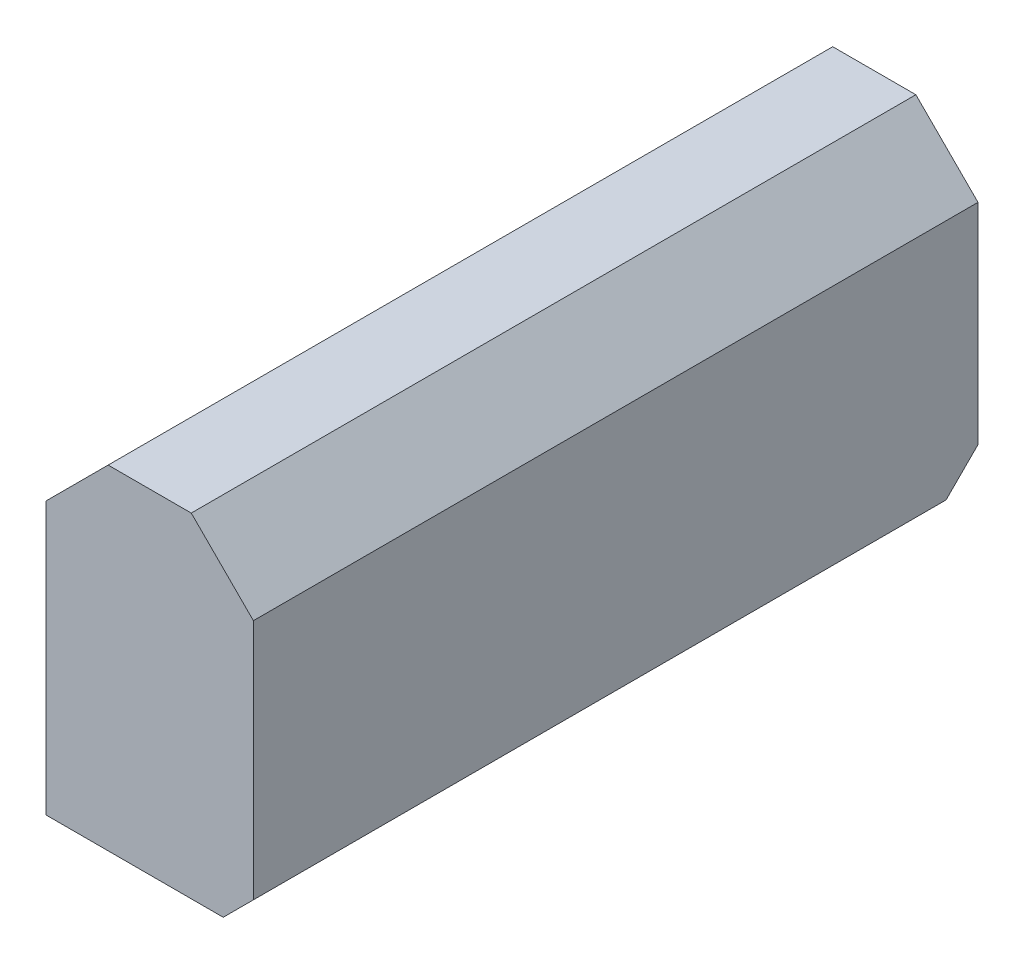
from build123d import *

# Parameters (mm, degrees)
SKETCH2_W           = 188.214
SKETCH2_H           = 116.84
BOSS_EXTRUDE1_DEPTH = 204.10347766
CHAMFER1_SIZE       = 17
CHAMFER2_SIZE       = 35
CHAMFER3_SIZE       = 35


with BuildPart() as part:
    # Sketch2 → Boss-Extrude1 (new, symmetric)
    with BuildSketch(Plane(origin=(0, 0, 0), x_dir=(0, 1, 0), z_dir=(0, 0, 1))):
        Rectangle(SKETCH2_W, SKETCH2_H)
    extrude(amount=BOSS_EXTRUDE1_DEPTH, both=True)

    # Chamfer1
    chamfer1_edges = [part.edges().sort_by_distance(p)[0] for p in [
        (58.42, -94.107, 0),
    ]]
    chamfer(chamfer1_edges, length=CHAMFER1_SIZE)

    # Chamfer2
    chamfer2_edges = [part.edges().sort_by_distance(p)[0] for p in [
        (58.42, 94.107, 0),
        (-58.42, 94.107, 0),
    ]]
    chamfer(chamfer2_edges, length=CHAMFER2_SIZE)

    # Chamfer3
    chamfer3_edges = [part.edges().sort_by_distance(p)[0] for p in [
        (-8.5, -94.107, -204.10347766),
    ]]
    chamfer(chamfer3_edges, length=CHAMFER3_SIZE)


solid = part.part
